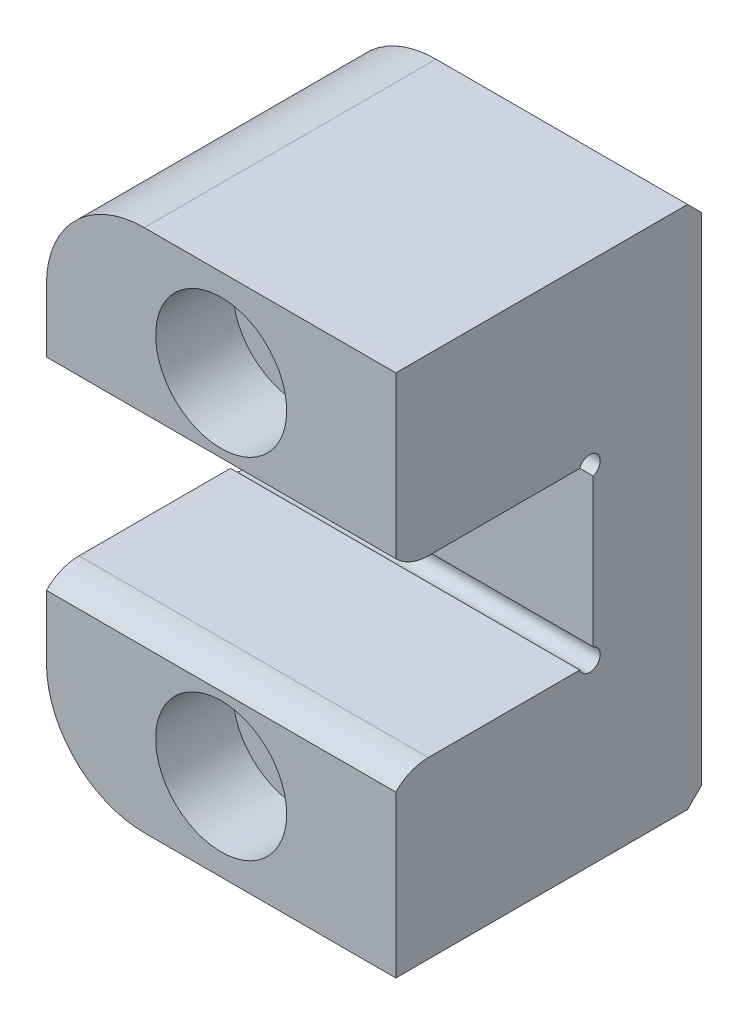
from build123d import *

# Parameters (mm, degrees)
EXTRUDE1_DEPTH         = 12.7
FILLET1_R              = 7.112
CUT_EXTRUDE1_DEPTH     = 37.753282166
CUT_EXTRUDE2_DEPTH     = 39.75581408
SKETCH6_R              = 0.762
CUT_EXTRUDE3_DEPTH     = 39.75581408
F_10_CBORE_D           = 5.6134
F_10_CBORE_CBORE_D     = 9.525
F_10_CBORE_CBORE_DEPTH = 5.61975
CHAMFER3_SIZE          = 3.81
CHAMFER3_SIZE2         = 1.020886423
CHAMFER1_SIZE          = 1.016


with BuildPart() as part:
    # Sketch1 → Extrude1 (new, symmetric)
    with BuildSketch(Plane(origin=(0, 0, 0), x_dir=(0, 0, -1), z_dir=(1, 0, 0))):
        Polygon((0, 6.35), (14.351, 6.35), (14.351, -6.35), (0, -6.35), (0, -19.05), (22.225, -19.05), (22.225, 19.05), (0, 19.05), align=None)
    extrude(amount=EXTRUDE1_DEPTH, both=True)

    # Fillet1
    fillet1_edges = [part.edges().sort_by_distance(p)[0] for p in [
        (-12.7, 19.05, -11.1125),
        (-12.7, -19.05, -11.1125),
    ]]
    fillet(fillet1_edges, radius=FILLET1_R)

    # Sketch2 → Cut-Extrude1 (cut, through all)
    with BuildSketch(Plane(origin=(-9.525, 0, -22.225), x_dir=(1, 0, 0), z_dir=(0, 0, 1))):
        Polygon((-4.7625, 5.679043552), (-4.7625, -5.679043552), (-1.5875, -3.845956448), (-1.5875, 3.845956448), align=None)
    extrude(amount=CUT_EXTRUDE1_DEPTH, mode=Mode.SUBTRACT)

    # Sketch5 → Cut-Extrude2 (cut, through all)
    with BuildSketch(Plane(origin=(12.7, 0, 0), x_dir=(0, 0, -1), z_dir=(1, 0, 0))):
        with BuildLine():
            Line((-3.9878, -4.171019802), (2.3622, -4.171019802))
            Line((2.3622, -4.171019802), (2.3622, -6.35))
            ThreePointArc((2.3622, -6.35), (1.080400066, -6.60918595), (0, -7.346019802))
            Line((0, -7.346019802), (-3.9878, -7.346019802))
            Line((-3.9878, -7.346019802), (-3.9878, -4.171019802))
        make_face()
        with BuildLine():
            Line((2.3622, 4.171019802), (2.3622, 6.35))
            ThreePointArc((2.3622, 6.35), (1.080400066, 6.60918595), (0, 7.346019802))
            Line((0, 7.346019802), (-3.9878, 7.346019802))
            Line((-3.9878, 7.346019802), (-3.9878, 4.171019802))
            Line((-3.9878, 4.171019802), (2.3622, 4.171019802))
        make_face()
    extrude(amount=-CUT_EXTRUDE2_DEPTH, mode=Mode.SUBTRACT)

    # Sketch6 → Cut-Extrude3 (cut, through all)
    with BuildSketch(Plane(origin=(12.7, 0, 0), x_dir=(0, 0, -1), z_dir=(1, 0, 0))):
        with Locations((14.097, 6.096)):
            Circle(SKETCH6_R)
        with Locations((14.097, -6.096)):
            Circle(SKETCH6_R)
    extrude(amount=-CUT_EXTRUDE3_DEPTH, mode=Mode.SUBTRACT)

    # 10 CBORE (through all)
    with Locations(Plane.XY):
        with Locations((0, 12.7), (0, -12.7)):
            CounterBoreHole(F_10_CBORE_D / 2, F_10_CBORE_CBORE_D / 2, F_10_CBORE_CBORE_DEPTH)

    # Chamfer3
    chamfer3_edges = [part.edges().sort_by_distance(p)[0] for p in [
        (-11.1125, 0, -14.351),
    ]]
    chamfer3_side = [part.faces().sort_by_distance(p)[0] for p in [
        (-11.1125, 0, -18.288),
    ]]
    chamfer(chamfer3_edges, length=CHAMFER3_SIZE, length2=CHAMFER3_SIZE2, reference=chamfer3_side[0])

    # Chamfer1
    chamfer1_edges = [part.edges().sort_by_distance(p)[0] for p in [
        (3.556, 19.05, -22.225),
        (3.556, -19.05, -22.225),
        (-12.7, -8.35025, -22.225),
        (-10.616943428, 16.966943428, -22.225),
        (-10.616943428, -16.966943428, -22.225),
        (-12.7, 8.35025, -22.225),
    ]]
    chamfer(chamfer1_edges, length=CHAMFER1_SIZE)


solid = part.part
